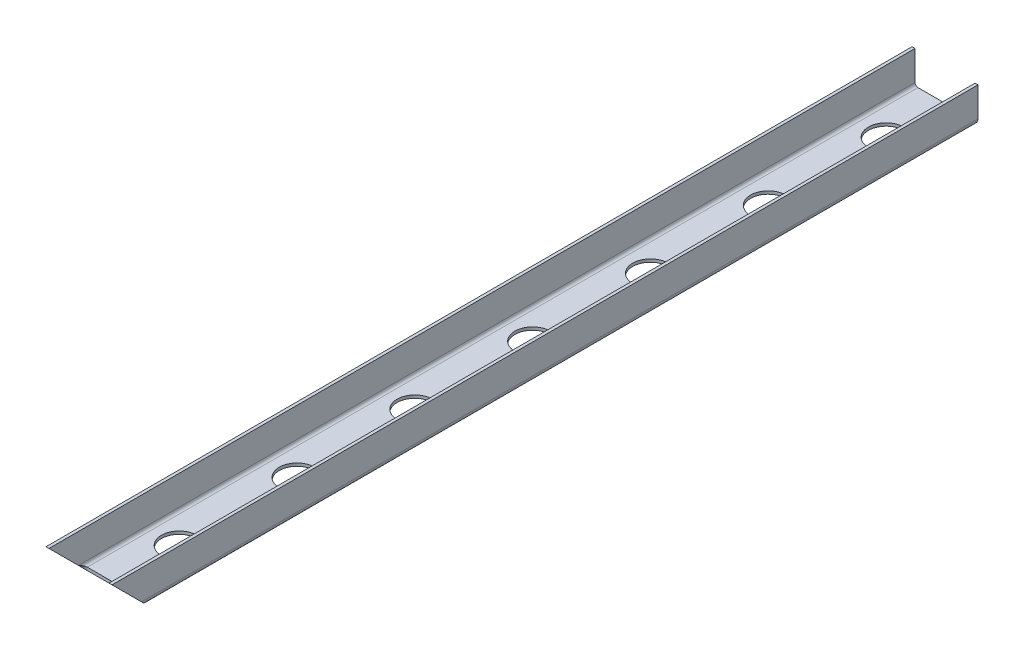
ISO-10303-21;
HEADER;
FILE_DESCRIPTION(('STEP AP214'),'2;1');
FILE_NAME('part.step','',(''),(''),'','','');
FILE_SCHEMA(('AUTOMOTIVE_DESIGN { 1 0 10303 214 1 1 1 1 }'));
ENDSEC;
DATA;
#1=APPLICATION_CONTEXT('core data for automotive mechanical design processes');
#2=APPLICATION_PROTOCOL_DEFINITION('international standard','automotive_design',2000,#1);
#3=PRODUCT_CONTEXT('',#1,'mechanical');
#4=PRODUCT('Part','Part','',(#3));
#5=PRODUCT_RELATED_PRODUCT_CATEGORY('part','',(#4));
#6=PRODUCT_DEFINITION_FORMATION('','',#4);
#7=PRODUCT_DEFINITION_CONTEXT('part definition',#1,'design');
#8=PRODUCT_DEFINITION('design','',#6,#7);
#9=PRODUCT_DEFINITION_SHAPE('','',#8);
#10=(LENGTH_UNIT() NAMED_UNIT(*) SI_UNIT(.MILLI.,.METRE.));
#11=(NAMED_UNIT(*) PLANE_ANGLE_UNIT() SI_UNIT($,.RADIAN.));
#12=(NAMED_UNIT(*) SI_UNIT($,.STERADIAN.) SOLID_ANGLE_UNIT());
#13=UNCERTAINTY_MEASURE_WITH_UNIT(LENGTH_MEASURE(1.E-05),#10,'distance_accuracy_value','');
#14=(GEOMETRIC_REPRESENTATION_CONTEXT(3) GLOBAL_UNCERTAINTY_ASSIGNED_CONTEXT((#13)) GLOBAL_UNIT_ASSIGNED_CONTEXT((#10,
#11,#12)) REPRESENTATION_CONTEXT('',''));
#15=CARTESIAN_POINT('',(0.,0.,0.));
#16=DIRECTION('',(0.,0.,1.));
#17=DIRECTION('',(1.,0.,0.));
#18=AXIS2_PLACEMENT_3D('',#15,#16,#17);
#19=CARTESIAN_POINT('',(28.,0.,367.5));
#20=DIRECTION('',(-1.,0.,0.));
#21=DIRECTION('',(0.,0.,1.));
#22=AXIS2_PLACEMENT_3D('',#19,#20,#21);
#23=PLANE('',#22);
#24=DIRECTION('',(0.,-0.707106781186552,-0.707106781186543));
#25=VECTOR('',#24,1.);
#26=CARTESIAN_POINT('',(28.,13.7499999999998,353.75));
#27=LINE('',#26,#25);
#28=CARTESIAN_POINT('',(28.,27.5,367.5));
#29=VERTEX_POINT('',#28);
#30=CARTESIAN_POINT('',(28.,2.50000000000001,342.5));
#31=VERTEX_POINT('',#30);
#32=EDGE_CURVE('E416',#29,#31,#27,.T.);
#33=ORIENTED_EDGE('',*,*,#32,.T.);
#34=DIRECTION('',(0.,0.,-1.));
#35=VECTOR('',#34,1.);
#36=CARTESIAN_POINT('',(28.,2.50000000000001,367.5));
#37=LINE('',#36,#35);
#38=CARTESIAN_POINT('',(28.,2.50000000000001,-367.5));
#39=VERTEX_POINT('',#38);
#40=EDGE_CURVE('E64',#31,#39,#37,.T.);
#41=ORIENTED_EDGE('',*,*,#40,.T.);
#42=DIRECTION('',(0.,1.,0.));
#43=VECTOR('',#42,1.);
#44=CARTESIAN_POINT('',(28.,0.,-367.5));
#45=LINE('',#44,#43);
#46=CARTESIAN_POINT('',(28.,27.5,-367.5));
#47=VERTEX_POINT('',#46);
#48=EDGE_CURVE('E411',#39,#47,#45,.T.);
#49=ORIENTED_EDGE('',*,*,#48,.T.);
#50=DIRECTION('',(0.,0.,-1.));
#51=VECTOR('',#50,1.);
#52=CARTESIAN_POINT('',(28.,27.5,367.5));
#53=LINE('',#52,#51);
#54=EDGE_CURVE('E207',#29,#47,#53,.T.);
#55=ORIENTED_EDGE('',*,*,#54,.F.);
#56=EDGE_LOOP('',(#33,#41,#49,#55));
#57=FACE_BOUND('',#56,.T.);
#58=ADVANCED_FACE('F40',(#57),#23,.F.);
#59=CARTESIAN_POINT('',(25.5,0.,367.5));
#60=DIRECTION('',(-1.,0.,0.));
#61=DIRECTION('',(0.,0.,1.));
#62=AXIS2_PLACEMENT_3D('',#59,#60,#61);
#63=PLANE('',#62);
#64=DIRECTION('',(0.,0.,-1.));
#65=VECTOR('',#64,1.);
#66=CARTESIAN_POINT('',(25.5,2.50000000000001,367.5));
#67=LINE('',#66,#65);
#68=CARTESIAN_POINT('',(25.5,2.50000000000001,342.5));
#69=VERTEX_POINT('',#68);
#70=CARTESIAN_POINT('',(25.5,2.50000000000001,-367.5));
#71=VERTEX_POINT('',#70);
#72=EDGE_CURVE('E201',#69,#71,#67,.T.);
#73=ORIENTED_EDGE('',*,*,#72,.F.);
#74=DIRECTION('',(0.,-0.707106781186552,-0.707106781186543));
#75=VECTOR('',#74,1.);
#76=CARTESIAN_POINT('',(25.5,13.7499999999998,353.75));
#77=LINE('',#76,#75);
#78=CARTESIAN_POINT('',(25.5,27.5,367.5));
#79=VERTEX_POINT('',#78);
#80=EDGE_CURVE('E419',#79,#69,#77,.T.);
#81=ORIENTED_EDGE('',*,*,#80,.F.);
#82=DIRECTION('',(0.,0.,-1.));
#83=VECTOR('',#82,1.);
#84=CARTESIAN_POINT('',(25.5,27.5,367.5));
#85=LINE('',#84,#83);
#86=CARTESIAN_POINT('',(25.5,27.5,-367.5));
#87=VERTEX_POINT('',#86);
#88=EDGE_CURVE('E204',#79,#87,#85,.T.);
#89=ORIENTED_EDGE('',*,*,#88,.T.);
#90=DIRECTION('',(0.,1.,0.));
#91=VECTOR('',#90,1.);
#92=CARTESIAN_POINT('',(25.5,0.,-367.5));
#93=LINE('',#92,#91);
#94=EDGE_CURVE('E403',#71,#87,#93,.T.);
#95=ORIENTED_EDGE('',*,*,#94,.F.);
#96=EDGE_LOOP('',(#73,#81,#89,#95));
#97=FACE_BOUND('',#96,.T.);
#98=ADVANCED_FACE('F275',(#97),#63,.T.);
#99=CARTESIAN_POINT('',(23.,2.50000000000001,367.5));
#100=DIRECTION('',(0.,0.,-1.));
#101=DIRECTION('',(-1.,0.,0.));
#102=AXIS2_PLACEMENT_3D('',#99,#100,#101);
#103=CYLINDRICAL_SURFACE('',#102,2.5);
#104=DIRECTION('',(0.,0.,-1.));
#105=VECTOR('',#104,1.);
#106=CARTESIAN_POINT('',(23.,0.,367.5));
#107=LINE('',#106,#105);
#108=CARTESIAN_POINT('',(23.,0.,337.5));
#109=VERTEX_POINT('',#108);
#110=CARTESIAN_POINT('',(23.,0.,-367.5));
#111=VERTEX_POINT('',#110);
#112=EDGE_CURVE('E198',#109,#111,#107,.T.);
#113=ORIENTED_EDGE('',*,*,#112,.F.);
#114=CARTESIAN_POINT('',(23.,2.50000000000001,342.5));
#115=DIRECTION('',(0.,0.894427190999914,-0.447213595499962));
#116=DIRECTION('',(0.,-0.447213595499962,-0.894427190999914));
#117=AXIS2_PLACEMENT_3D('',#114,#115,#116);
#118=ELLIPSE('',#117,5.59016994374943,2.5);
#119=EDGE_CURVE('E139',#69,#109,#118,.T.);
#120=ORIENTED_EDGE('',*,*,#119,.F.);
#121=ORIENTED_EDGE('',*,*,#72,.T.);
#122=CARTESIAN_POINT('',(23.,2.50000000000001,-367.5));
#123=DIRECTION('',(0.,0.,-1.));
#124=DIRECTION('',(-1.,0.,0.));
#125=AXIS2_PLACEMENT_3D('',#122,#123,#124);
#126=CIRCLE('',#125,2.5);
#127=EDGE_CURVE('E400',#111,#71,#126,.F.);
#128=ORIENTED_EDGE('',*,*,#127,.F.);
#129=EDGE_LOOP('',(#113,#120,#121,#128));
#130=FACE_BOUND('',#129,.T.);
#131=ADVANCED_FACE('F265',(#130),#103,.F.);
#132=CARTESIAN_POINT('',(-25.5,0.,367.5));
#133=DIRECTION('',(0.,1.,0.));
#134=DIRECTION('',(-1.,0.,0.));
#135=AXIS2_PLACEMENT_3D('',#132,#133,#134);
#136=PLANE('',#135);
#137=CARTESIAN_POINT('',(0.,0.,-217.5));
#138=DIRECTION('',(0.,1.,0.));
#139=DIRECTION('',(-1.,0.,0.));
#140=AXIS2_PLACEMENT_3D('',#137,#138,#139);
#141=CIRCLE('',#140,15.);
#142=CARTESIAN_POINT('',(-15.,0.,-217.5));
#143=VERTEX_POINT('',#142);
#144=EDGE_CURVE('E454',#143,#143,#141,.T.);
#145=ORIENTED_EDGE('',*,*,#144,.F.);
#146=EDGE_LOOP('',(#145));
#147=FACE_BOUND('',#146,.T.);
#148=CARTESIAN_POINT('',(0.,0.,-317.5));
#149=DIRECTION('',(0.,1.,0.));
#150=DIRECTION('',(-1.,0.,0.));
#151=AXIS2_PLACEMENT_3D('',#148,#149,#150);
#152=CIRCLE('',#151,15.);
#153=CARTESIAN_POINT('',(-15.,0.,-317.5));
#154=VERTEX_POINT('',#153);
#155=EDGE_CURVE('E446',#154,#154,#152,.T.);
#156=ORIENTED_EDGE('',*,*,#155,.F.);
#157=EDGE_LOOP('',(#156));
#158=FACE_BOUND('',#157,.T.);
#159=DIRECTION('',(0.,0.,-1.));
#160=VECTOR('',#159,1.);
#161=CARTESIAN_POINT('',(-23.,0.,367.5));
#162=LINE('',#161,#160);
#163=CARTESIAN_POINT('',(-23.,0.,337.5));
#164=VERTEX_POINT('',#163);
#165=CARTESIAN_POINT('',(-23.,0.,-367.5));
#166=VERTEX_POINT('',#165);
#167=EDGE_CURVE('E195',#164,#166,#162,.T.);
#168=ORIENTED_EDGE('',*,*,#167,.F.);
#169=DIRECTION('',(-1.,0.,0.));
#170=VECTOR('',#169,1.);
#171=CARTESIAN_POINT('',(-25.5,0.,337.5));
#172=LINE('',#171,#170);
#173=EDGE_CURVE('E144',#164,#109,#172,.F.);
#174=ORIENTED_EDGE('',*,*,#173,.T.);
#175=ORIENTED_EDGE('',*,*,#112,.T.);
#176=DIRECTION('',(1.,0.,0.));
#177=VECTOR('',#176,1.);
#178=CARTESIAN_POINT('',(-25.5,0.,-367.5));
#179=LINE('',#178,#177);
#180=EDGE_CURVE('E396',#166,#111,#179,.T.);
#181=ORIENTED_EDGE('',*,*,#180,.F.);
#182=EDGE_LOOP('',(#168,#174,#175,#181));
#183=FACE_BOUND('',#182,.T.);
#184=CARTESIAN_POINT('',(0.,0.,-117.5));
#185=DIRECTION('',(0.,1.,0.));
#186=DIRECTION('',(-1.,0.,0.));
#187=AXIS2_PLACEMENT_3D('',#184,#185,#186);
#188=CIRCLE('',#187,15.);
#189=CARTESIAN_POINT('',(-15.,0.,-117.5));
#190=VERTEX_POINT('',#189);
#191=EDGE_CURVE('E225',#190,#190,#188,.T.);
#192=ORIENTED_EDGE('',*,*,#191,.F.);
#193=EDGE_LOOP('',(#192));
#194=FACE_BOUND('',#193,.T.);
#195=CARTESIAN_POINT('',(0.,0.,-17.5));
#196=DIRECTION('',(0.,1.,0.));
#197=DIRECTION('',(-1.,0.,0.));
#198=AXIS2_PLACEMENT_3D('',#195,#196,#197);
#199=CIRCLE('',#198,15.);
#200=CARTESIAN_POINT('',(-15.,0.,-17.5));
#201=VERTEX_POINT('',#200);
#202=EDGE_CURVE('E233',#201,#201,#199,.T.);
#203=ORIENTED_EDGE('',*,*,#202,.F.);
#204=EDGE_LOOP('',(#203));
#205=FACE_BOUND('',#204,.T.);
#206=CARTESIAN_POINT('',(0.,0.,82.5));
#207=DIRECTION('',(0.,1.,0.));
#208=DIRECTION('',(-1.,0.,0.));
#209=AXIS2_PLACEMENT_3D('',#206,#207,#208);
#210=CIRCLE('',#209,15.);
#211=CARTESIAN_POINT('',(-15.,0.,82.5));
#212=VERTEX_POINT('',#211);
#213=EDGE_CURVE('E241',#212,#212,#210,.T.);
#214=ORIENTED_EDGE('',*,*,#213,.F.);
#215=EDGE_LOOP('',(#214));
#216=FACE_BOUND('',#215,.T.);
#217=CARTESIAN_POINT('',(0.,0.,182.5));
#218=DIRECTION('',(0.,1.,0.));
#219=DIRECTION('',(-1.,0.,0.));
#220=AXIS2_PLACEMENT_3D('',#217,#218,#219);
#221=CIRCLE('',#220,15.);
#222=CARTESIAN_POINT('',(-15.,0.,182.5));
#223=VERTEX_POINT('',#222);
#224=EDGE_CURVE('E249',#223,#223,#221,.T.);
#225=ORIENTED_EDGE('',*,*,#224,.F.);
#226=EDGE_LOOP('',(#225));
#227=FACE_BOUND('',#226,.T.);
#228=CARTESIAN_POINT('',(0.,0.,282.5));
#229=DIRECTION('',(0.,1.,0.));
#230=DIRECTION('',(-1.,0.,0.));
#231=AXIS2_PLACEMENT_3D('',#228,#229,#230);
#232=CIRCLE('',#231,15.);
#233=CARTESIAN_POINT('',(-15.,0.,282.5));
#234=VERTEX_POINT('',#233);
#235=EDGE_CURVE('E49',#234,#234,#232,.T.);
#236=ORIENTED_EDGE('',*,*,#235,.F.);
#237=EDGE_LOOP('',(#236));
#238=FACE_BOUND('',#237,.T.);
#239=ADVANCED_FACE('F262',(#147,#158,#183,#194,#205,#216,#227,#238),#136,.T.);
#240=CARTESIAN_POINT('',(-23.,2.5,367.5));
#241=DIRECTION('',(0.,0.,-1.));
#242=DIRECTION('',(-1.,0.,0.));
#243=AXIS2_PLACEMENT_3D('',#240,#241,#242);
#244=CYLINDRICAL_SURFACE('',#243,2.5);
#245=DIRECTION('',(0.,0.,-1.));
#246=VECTOR('',#245,1.);
#247=CARTESIAN_POINT('',(-25.5,2.5,367.5));
#248=LINE('',#247,#246);
#249=CARTESIAN_POINT('',(-25.5,2.5,342.5));
#250=VERTEX_POINT('',#249);
#251=CARTESIAN_POINT('',(-25.5,2.5,-367.5));
#252=VERTEX_POINT('',#251);
#253=EDGE_CURVE('E192',#250,#252,#248,.T.);
#254=ORIENTED_EDGE('',*,*,#253,.F.);
#255=CARTESIAN_POINT('',(-23.,2.5,342.5));
#256=DIRECTION('',(0.,0.894427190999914,-0.447213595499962));
#257=DIRECTION('',(0.,-0.447213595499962,-0.894427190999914));
#258=AXIS2_PLACEMENT_3D('',#255,#256,#257);
#259=ELLIPSE('',#258,5.59016994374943,2.5);
#260=EDGE_CURVE('E434',#164,#250,#259,.T.);
#261=ORIENTED_EDGE('',*,*,#260,.F.);
#262=ORIENTED_EDGE('',*,*,#167,.T.);
#263=CARTESIAN_POINT('',(-23.,2.5,-367.5));
#264=DIRECTION('',(0.,0.,-1.));
#265=DIRECTION('',(-1.,0.,0.));
#266=AXIS2_PLACEMENT_3D('',#263,#264,#265);
#267=CIRCLE('',#266,2.5);
#268=EDGE_CURVE('E392',#252,#166,#267,.F.);
#269=ORIENTED_EDGE('',*,*,#268,.F.);
#270=EDGE_LOOP('',(#254,#261,#262,#269));
#271=FACE_BOUND('',#270,.T.);
#272=ADVANCED_FACE('F264',(#271),#244,.F.);
#273=CARTESIAN_POINT('',(-25.5,27.5,367.5));
#274=DIRECTION('',(1.,0.,0.));
#275=DIRECTION('',(0.,1.,0.));
#276=AXIS2_PLACEMENT_3D('',#273,#274,#275);
#277=PLANE('',#276);
#278=DIRECTION('',(0.,0.,-1.));
#279=VECTOR('',#278,1.);
#280=CARTESIAN_POINT('',(-25.5,27.5,367.5));
#281=LINE('',#280,#279);
#282=CARTESIAN_POINT('',(-25.5,27.5,367.5));
#283=VERTEX_POINT('',#282);
#284=CARTESIAN_POINT('',(-25.5,27.5,-367.5));
#285=VERTEX_POINT('',#284);
#286=EDGE_CURVE('E189',#283,#285,#281,.T.);
#287=ORIENTED_EDGE('',*,*,#286,.F.);
#288=DIRECTION('',(0.,0.707106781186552,0.707106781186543));
#289=VECTOR('',#288,1.);
#290=CARTESIAN_POINT('',(-25.5,-2.5,337.5));
#291=LINE('',#290,#289);
#292=EDGE_CURVE('E56',#250,#283,#291,.T.);
#293=ORIENTED_EDGE('',*,*,#292,.F.);
#294=ORIENTED_EDGE('',*,*,#253,.T.);
#295=DIRECTION('',(0.,-1.,0.));
#296=VECTOR('',#295,1.);
#297=CARTESIAN_POINT('',(-25.5,27.5,-367.5));
#298=LINE('',#297,#296);
#299=EDGE_CURVE('E362',#285,#252,#298,.T.);
#300=ORIENTED_EDGE('',*,*,#299,.F.);
#301=EDGE_LOOP('',(#287,#293,#294,#300));
#302=FACE_BOUND('',#301,.T.);
#303=ADVANCED_FACE('F272',(#302),#277,.T.);
#304=CARTESIAN_POINT('',(-28.,27.5,367.5));
#305=DIRECTION('',(1.,0.,0.));
#306=DIRECTION('',(0.,1.,0.));
#307=AXIS2_PLACEMENT_3D('',#304,#305,#306);
#308=PLANE('',#307);
#309=DIRECTION('',(0.,0.707106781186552,0.707106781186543));
#310=VECTOR('',#309,1.);
#311=CARTESIAN_POINT('',(-28.,-2.5,337.5));
#312=LINE('',#311,#310);
#313=CARTESIAN_POINT('',(-28.,2.5,342.5));
#314=VERTEX_POINT('',#313);
#315=CARTESIAN_POINT('',(-28.,27.5,367.5));
#316=VERTEX_POINT('',#315);
#317=EDGE_CURVE('E431',#314,#316,#312,.T.);
#318=ORIENTED_EDGE('',*,*,#317,.T.);
#319=DIRECTION('',(0.,0.,-1.));
#320=VECTOR('',#319,1.);
#321=CARTESIAN_POINT('',(-28.,27.5,367.5));
#322=LINE('',#321,#320);
#323=CARTESIAN_POINT('',(-28.,27.5,-367.5));
#324=VERTEX_POINT('',#323);
#325=EDGE_CURVE('E186',#316,#324,#322,.T.);
#326=ORIENTED_EDGE('',*,*,#325,.T.);
#327=DIRECTION('',(0.,-1.,0.));
#328=VECTOR('',#327,1.);
#329=CARTESIAN_POINT('',(-28.,27.5,-367.5));
#330=LINE('',#329,#328);
#331=CARTESIAN_POINT('',(-28.,2.5,-367.5));
#332=VERTEX_POINT('',#331);
#333=EDGE_CURVE('E383',#324,#332,#330,.T.);
#334=ORIENTED_EDGE('',*,*,#333,.T.);
#335=DIRECTION('',(0.,0.,-1.));
#336=VECTOR('',#335,1.);
#337=CARTESIAN_POINT('',(-28.,2.5,367.5));
#338=LINE('',#337,#336);
#339=EDGE_CURVE('E177',#314,#332,#338,.T.);
#340=ORIENTED_EDGE('',*,*,#339,.F.);
#341=EDGE_LOOP('',(#318,#326,#334,#340));
#342=FACE_BOUND('',#341,.T.);
#343=ADVANCED_FACE('F339',(#342),#308,.F.);
#344=CARTESIAN_POINT('',(-23.,2.5,367.5));
#345=DIRECTION('',(0.,0.,-1.));
#346=DIRECTION('',(-1.,0.,0.));
#347=AXIS2_PLACEMENT_3D('',#344,#345,#346);
#348=CYLINDRICAL_SURFACE('',#347,5.);
#349=CARTESIAN_POINT('',(-23.,2.5,342.5));
#350=DIRECTION('',(0.,0.707106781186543,-0.707106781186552));
#351=DIRECTION('',(0.,-0.707106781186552,-0.707106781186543));
#352=AXIS2_PLACEMENT_3D('',#349,#350,#351);
#353=ELLIPSE('',#352,7.07106781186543,5.);
#354=CARTESIAN_POINT('',(-23.,-2.5,337.5));
#355=VERTEX_POINT('',#354);
#356=EDGE_CURVE('E437',#355,#314,#353,.T.);
#357=ORIENTED_EDGE('',*,*,#356,.T.);
#358=ORIENTED_EDGE('',*,*,#339,.T.);
#359=CARTESIAN_POINT('',(-23.,2.5,-367.5));
#360=DIRECTION('',(0.,0.,1.));
#361=DIRECTION('',(1.,0.,0.));
#362=AXIS2_PLACEMENT_3D('',#359,#360,#361);
#363=CIRCLE('',#362,5.);
#364=CARTESIAN_POINT('',(-23.,-2.5,-367.5));
#365=VERTEX_POINT('',#364);
#366=EDGE_CURVE('E379',#332,#365,#363,.T.);
#367=ORIENTED_EDGE('',*,*,#366,.T.);
#368=DIRECTION('',(0.,0.,-1.));
#369=VECTOR('',#368,1.);
#370=CARTESIAN_POINT('',(-23.,-2.5,367.5));
#371=LINE('',#370,#369);
#372=EDGE_CURVE('E172',#355,#365,#371,.T.);
#373=ORIENTED_EDGE('',*,*,#372,.F.);
#374=EDGE_LOOP('',(#357,#358,#367,#373));
#375=FACE_BOUND('',#374,.T.);
#376=ADVANCED_FACE('F330',(#375),#348,.T.);
#377=CARTESIAN_POINT('',(-25.5,-2.5,367.5));
#378=DIRECTION('',(0.,1.,0.));
#379=DIRECTION('',(-1.,0.,0.));
#380=AXIS2_PLACEMENT_3D('',#377,#378,#379);
#381=PLANE('',#380);
#382=CARTESIAN_POINT('',(0.,-2.5,-217.5));
#383=DIRECTION('',(0.,1.,0.));
#384=DIRECTION('',(-1.,0.,0.));
#385=AXIS2_PLACEMENT_3D('',#382,#383,#384);
#386=CIRCLE('',#385,15.);
#387=CARTESIAN_POINT('',(-15.,-2.5,-217.5));
#388=VERTEX_POINT('',#387);
#389=EDGE_CURVE('E450',#388,#388,#386,.F.);
#390=ORIENTED_EDGE('',*,*,#389,.F.);
#391=EDGE_LOOP('',(#390));
#392=FACE_BOUND('',#391,.T.);
#393=CARTESIAN_POINT('',(0.,-2.5,-317.5));
#394=DIRECTION('',(0.,1.,0.));
#395=DIRECTION('',(-1.,0.,0.));
#396=AXIS2_PLACEMENT_3D('',#393,#394,#395);
#397=CIRCLE('',#396,15.);
#398=CARTESIAN_POINT('',(-15.,-2.5,-317.5));
#399=VERTEX_POINT('',#398);
#400=EDGE_CURVE('E163',#399,#399,#397,.F.);
#401=ORIENTED_EDGE('',*,*,#400,.F.);
#402=EDGE_LOOP('',(#401));
#403=FACE_BOUND('',#402,.T.);
#404=DIRECTION('',(1.,0.,0.));
#405=VECTOR('',#404,1.);
#406=CARTESIAN_POINT('',(-28.,-2.5,337.5));
#407=LINE('',#406,#405);
#408=CARTESIAN_POINT('',(23.,-2.49999999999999,337.5));
#409=VERTEX_POINT('',#408);
#410=EDGE_CURVE('E147',#355,#409,#407,.T.);
#411=ORIENTED_EDGE('',*,*,#410,.F.);
#412=ORIENTED_EDGE('',*,*,#372,.T.);
#413=DIRECTION('',(1.,0.,0.));
#414=VECTOR('',#413,1.);
#415=CARTESIAN_POINT('',(-25.5,-2.5,-367.5));
#416=LINE('',#415,#414);
#417=CARTESIAN_POINT('',(23.,-2.49999999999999,-367.5));
#418=VERTEX_POINT('',#417);
#419=EDGE_CURVE('E169',#365,#418,#416,.T.);
#420=ORIENTED_EDGE('',*,*,#419,.T.);
#421=DIRECTION('',(0.,0.,-1.));
#422=VECTOR('',#421,1.);
#423=CARTESIAN_POINT('',(23.,-2.49999999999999,367.5));
#424=LINE('',#423,#422);
#425=EDGE_CURVE('E160',#409,#418,#424,.T.);
#426=ORIENTED_EDGE('',*,*,#425,.F.);
#427=EDGE_LOOP('',(#411,#412,#420,#426));
#428=FACE_BOUND('',#427,.T.);
#429=CARTESIAN_POINT('',(0.,-2.5,-117.5));
#430=DIRECTION('',(0.,1.,0.));
#431=DIRECTION('',(-1.,0.,0.));
#432=AXIS2_PLACEMENT_3D('',#429,#430,#431);
#433=CIRCLE('',#432,15.);
#434=CARTESIAN_POINT('',(-15.,-2.5,-117.5));
#435=VERTEX_POINT('',#434);
#436=EDGE_CURVE('E229',#435,#435,#433,.F.);
#437=ORIENTED_EDGE('',*,*,#436,.F.);
#438=EDGE_LOOP('',(#437));
#439=FACE_BOUND('',#438,.T.);
#440=CARTESIAN_POINT('',(0.,-2.5,-17.5));
#441=DIRECTION('',(0.,1.,0.));
#442=DIRECTION('',(-1.,0.,0.));
#443=AXIS2_PLACEMENT_3D('',#440,#441,#442);
#444=CIRCLE('',#443,15.);
#445=CARTESIAN_POINT('',(-15.,-2.5,-17.5));
#446=VERTEX_POINT('',#445);
#447=EDGE_CURVE('E237',#446,#446,#444,.F.);
#448=ORIENTED_EDGE('',*,*,#447,.F.);
#449=EDGE_LOOP('',(#448));
#450=FACE_BOUND('',#449,.T.);
#451=CARTESIAN_POINT('',(0.,-2.5,82.5));
#452=DIRECTION('',(0.,1.,0.));
#453=DIRECTION('',(-1.,0.,0.));
#454=AXIS2_PLACEMENT_3D('',#451,#452,#453);
#455=CIRCLE('',#454,15.);
#456=CARTESIAN_POINT('',(-15.,-2.5,82.5));
#457=VERTEX_POINT('',#456);
#458=EDGE_CURVE('E245',#457,#457,#455,.F.);
#459=ORIENTED_EDGE('',*,*,#458,.F.);
#460=EDGE_LOOP('',(#459));
#461=FACE_BOUND('',#460,.T.);
#462=CARTESIAN_POINT('',(0.,-2.5,182.5));
#463=DIRECTION('',(0.,1.,0.));
#464=DIRECTION('',(-1.,0.,0.));
#465=AXIS2_PLACEMENT_3D('',#462,#463,#464);
#466=CIRCLE('',#465,15.);
#467=CARTESIAN_POINT('',(-15.,-2.5,182.5));
#468=VERTEX_POINT('',#467);
#469=EDGE_CURVE('E253',#468,#468,#466,.F.);
#470=ORIENTED_EDGE('',*,*,#469,.F.);
#471=EDGE_LOOP('',(#470));
#472=FACE_BOUND('',#471,.T.);
#473=CARTESIAN_POINT('',(0.,-2.5,282.5));
#474=DIRECTION('',(0.,1.,0.));
#475=DIRECTION('',(-1.,0.,0.));
#476=AXIS2_PLACEMENT_3D('',#473,#474,#475);
#477=CIRCLE('',#476,15.);
#478=CARTESIAN_POINT('',(-15.,-2.5,282.5));
#479=VERTEX_POINT('',#478);
#480=EDGE_CURVE('E11',#479,#479,#477,.F.);
#481=ORIENTED_EDGE('',*,*,#480,.F.);
#482=EDGE_LOOP('',(#481));
#483=FACE_BOUND('',#482,.T.);
#484=ADVANCED_FACE('F166',(#392,#403,#428,#439,#450,#461,#472,#483),#381,.F.);
#485=CARTESIAN_POINT('',(23.,2.50000000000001,367.5));
#486=DIRECTION('',(0.,0.,-1.));
#487=DIRECTION('',(-1.,0.,0.));
#488=AXIS2_PLACEMENT_3D('',#485,#486,#487);
#489=CYLINDRICAL_SURFACE('',#488,5.);
#490=CARTESIAN_POINT('',(23.,2.50000000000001,342.5));
#491=DIRECTION('',(0.,0.707106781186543,-0.707106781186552));
#492=DIRECTION('',(0.,-0.707106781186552,-0.707106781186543));
#493=AXIS2_PLACEMENT_3D('',#490,#491,#492);
#494=ELLIPSE('',#493,7.07106781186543,5.);
#495=EDGE_CURVE('E136',#31,#409,#494,.T.);
#496=ORIENTED_EDGE('',*,*,#495,.T.);
#497=ORIENTED_EDGE('',*,*,#425,.T.);
#498=CARTESIAN_POINT('',(23.,2.50000000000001,-367.5));
#499=DIRECTION('',(0.,0.,1.));
#500=DIRECTION('',(1.,0.,0.));
#501=AXIS2_PLACEMENT_3D('',#498,#499,#500);
#502=CIRCLE('',#501,5.);
#503=EDGE_CURVE('E372',#418,#39,#502,.T.);
#504=ORIENTED_EDGE('',*,*,#503,.T.);
#505=ORIENTED_EDGE('',*,*,#40,.F.);
#506=EDGE_LOOP('',(#496,#497,#504,#505));
#507=FACE_BOUND('',#506,.T.);
#508=ADVANCED_FACE('F158',(#507),#489,.T.);
#509=CARTESIAN_POINT('',(-25.5,2.5,-367.5));
#510=DIRECTION('',(0.,0.,-1.));
#511=DIRECTION('',(-1.,0.,0.));
#512=AXIS2_PLACEMENT_3D('',#509,#510,#511);
#513=PLANE('',#512);
#514=DIRECTION('',(-1.,0.,0.));
#515=VECTOR('',#514,1.);
#516=CARTESIAN_POINT('',(-25.5,2.5,-367.5));
#517=LINE('',#516,#515);
#518=EDGE_CURVE('E221',#252,#332,#517,.T.);
#519=ORIENTED_EDGE('',*,*,#518,.F.);
#520=ORIENTED_EDGE('',*,*,#268,.T.);
#521=DIRECTION('',(0.,1.,0.));
#522=VECTOR('',#521,1.);
#523=CARTESIAN_POINT('',(-23.,-2.5,-367.5));
#524=LINE('',#523,#522);
#525=EDGE_CURVE('E217',#365,#166,#524,.T.);
#526=ORIENTED_EDGE('',*,*,#525,.F.);
#527=ORIENTED_EDGE('',*,*,#366,.F.);
#528=EDGE_LOOP('',(#519,#520,#526,#527));
#529=FACE_BOUND('',#528,.T.);
#530=ADVANCED_FACE('F301',(#529),#513,.T.);
#531=CARTESIAN_POINT('',(-23.,-2.5,-367.5));
#532=DIRECTION('',(0.,0.,-1.));
#533=DIRECTION('',(-1.,0.,0.));
#534=AXIS2_PLACEMENT_3D('',#531,#532,#533);
#535=PLANE('',#534);
#536=ORIENTED_EDGE('',*,*,#299,.T.);
#537=ORIENTED_EDGE('',*,*,#518,.T.);
#538=ORIENTED_EDGE('',*,*,#333,.F.);
#539=DIRECTION('',(1.,0.,0.));
#540=VECTOR('',#539,1.);
#541=CARTESIAN_POINT('',(-28.,27.5,-367.5));
#542=LINE('',#541,#540);
#543=EDGE_CURVE('E387',#324,#285,#542,.T.);
#544=ORIENTED_EDGE('',*,*,#543,.T.);
#545=EDGE_LOOP('',(#536,#537,#538,#544));
#546=FACE_BOUND('',#545,.T.);
#547=ADVANCED_FACE('F297',(#546),#535,.T.);
#548=CARTESIAN_POINT('',(23.,0.,-367.5));
#549=DIRECTION('',(0.,0.,-1.));
#550=DIRECTION('',(-1.,0.,0.));
#551=AXIS2_PLACEMENT_3D('',#548,#549,#550);
#552=PLANE('',#551);
#553=DIRECTION('',(0.,-1.,0.));
#554=VECTOR('',#553,1.);
#555=CARTESIAN_POINT('',(23.,0.,-367.5));
#556=LINE('',#555,#554);
#557=EDGE_CURVE('E214',#111,#418,#556,.T.);
#558=ORIENTED_EDGE('',*,*,#557,.F.);
#559=ORIENTED_EDGE('',*,*,#127,.T.);
#560=DIRECTION('',(-1.,0.,0.));
#561=VECTOR('',#560,1.);
#562=CARTESIAN_POINT('',(28.,2.50000000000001,-367.5));
#563=LINE('',#562,#561);
#564=EDGE_CURVE('E210',#39,#71,#563,.T.);
#565=ORIENTED_EDGE('',*,*,#564,.F.);
#566=ORIENTED_EDGE('',*,*,#503,.F.);
#567=EDGE_LOOP('',(#558,#559,#565,#566));
#568=FACE_BOUND('',#567,.T.);
#569=ADVANCED_FACE('F293',(#568),#552,.T.);
#570=CARTESIAN_POINT('',(28.,2.50000000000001,-367.5));
#571=DIRECTION('',(0.,0.,-1.));
#572=DIRECTION('',(-1.,0.,0.));
#573=AXIS2_PLACEMENT_3D('',#570,#571,#572);
#574=PLANE('',#573);
#575=ORIENTED_EDGE('',*,*,#180,.T.);
#576=ORIENTED_EDGE('',*,*,#557,.T.);
#577=ORIENTED_EDGE('',*,*,#419,.F.);
#578=ORIENTED_EDGE('',*,*,#525,.T.);
#579=EDGE_LOOP('',(#575,#576,#577,#578));
#580=FACE_BOUND('',#579,.T.);
#581=ADVANCED_FACE('F290',(#580),#574,.T.);
#582=CARTESIAN_POINT('',(25.5,27.5,367.5));
#583=DIRECTION('',(0.,1.,0.));
#584=DIRECTION('',(0.,0.,1.));
#585=AXIS2_PLACEMENT_3D('',#582,#583,#584);
#586=PLANE('',#585);
#587=DIRECTION('',(1.,0.,0.));
#588=VECTOR('',#587,1.);
#589=CARTESIAN_POINT('',(25.5,27.5,-367.5));
#590=LINE('',#589,#588);
#591=EDGE_CURVE('E407',#87,#47,#590,.T.);
#592=ORIENTED_EDGE('',*,*,#591,.F.);
#593=ORIENTED_EDGE('',*,*,#88,.F.);
#594=DIRECTION('',(1.,0.,0.));
#595=VECTOR('',#594,1.);
#596=CARTESIAN_POINT('',(25.5,27.5,367.5));
#597=LINE('',#596,#595);
#598=EDGE_CURVE('E369',#79,#29,#597,.T.);
#599=ORIENTED_EDGE('',*,*,#598,.T.);
#600=ORIENTED_EDGE('',*,*,#54,.T.);
#601=EDGE_LOOP('',(#592,#593,#599,#600));
#602=FACE_BOUND('',#601,.T.);
#603=ADVANCED_FACE('F289',(#602),#586,.T.);
#604=CARTESIAN_POINT('',(-28.,27.5,367.5));
#605=DIRECTION('',(0.,1.,0.));
#606=DIRECTION('',(0.,0.,1.));
#607=AXIS2_PLACEMENT_3D('',#604,#605,#606);
#608=PLANE('',#607);
#609=ORIENTED_EDGE('',*,*,#543,.F.);
#610=ORIENTED_EDGE('',*,*,#325,.F.);
#611=DIRECTION('',(1.,0.,0.));
#612=VECTOR('',#611,1.);
#613=CARTESIAN_POINT('',(-28.,27.5,367.5));
#614=LINE('',#613,#612);
#615=EDGE_CURVE('E180',#316,#283,#614,.T.);
#616=ORIENTED_EDGE('',*,*,#615,.T.);
#617=ORIENTED_EDGE('',*,*,#286,.T.);
#618=EDGE_LOOP('',(#609,#610,#616,#617));
#619=FACE_BOUND('',#618,.T.);
#620=ADVANCED_FACE('F349',(#619),#608,.T.);
#621=CARTESIAN_POINT('',(23.,2.50000000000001,-367.5));
#622=DIRECTION('',(0.,0.,-1.));
#623=DIRECTION('',(-1.,0.,0.));
#624=AXIS2_PLACEMENT_3D('',#621,#622,#623);
#625=PLANE('',#624);
#626=ORIENTED_EDGE('',*,*,#48,.F.);
#627=ORIENTED_EDGE('',*,*,#564,.T.);
#628=ORIENTED_EDGE('',*,*,#94,.T.);
#629=ORIENTED_EDGE('',*,*,#591,.T.);
#630=EDGE_LOOP('',(#626,#627,#628,#629));
#631=FACE_BOUND('',#630,.T.);
#632=ADVANCED_FACE('F352',(#631),#625,.T.);
#633=CARTESIAN_POINT('',(25.5,13.7499999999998,353.75));
#634=DIRECTION('',(0.,0.707106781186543,-0.707106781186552));
#635=DIRECTION('',(0.,-0.707106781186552,-0.707106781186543));
#636=AXIS2_PLACEMENT_3D('',#633,#634,#635);
#637=PLANE('',#636);
#638=ORIENTED_EDGE('',*,*,#80,.T.);
#639=DIRECTION('',(-1.,0.,0.));
#640=VECTOR('',#639,1.);
#641=CARTESIAN_POINT('',(25.5,2.50000000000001,342.5));
#642=LINE('',#641,#640);
#643=EDGE_CURVE('E413',#69,#31,#642,.F.);
#644=ORIENTED_EDGE('',*,*,#643,.T.);
#645=ORIENTED_EDGE('',*,*,#32,.F.);
#646=ORIENTED_EDGE('',*,*,#598,.F.);
#647=EDGE_LOOP('',(#638,#644,#645,#646));
#648=FACE_BOUND('',#647,.T.);
#649=ADVANCED_FACE('F493',(#648),#637,.F.);
#650=CARTESIAN_POINT('',(-28.,-2.5,337.5));
#651=DIRECTION('',(0.,0.,1.));
#652=DIRECTION('',(1.,0.,0.));
#653=AXIS2_PLACEMENT_3D('',#650,#651,#652);
#654=PLANE('',#653);
#655=DIRECTION('',(0.,-1.,0.));
#656=VECTOR('',#655,1.);
#657=CARTESIAN_POINT('',(-23.,-2.5,337.5));
#658=LINE('',#657,#656);
#659=EDGE_CURVE('E143',#355,#164,#658,.F.);
#660=ORIENTED_EDGE('',*,*,#659,.F.);
#661=ORIENTED_EDGE('',*,*,#410,.T.);
#662=DIRECTION('',(0.,-1.,0.));
#663=VECTOR('',#662,1.);
#664=CARTESIAN_POINT('',(23.,-2.49999999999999,337.5));
#665=LINE('',#664,#663);
#666=EDGE_CURVE('E132',#409,#109,#665,.F.);
#667=ORIENTED_EDGE('',*,*,#666,.T.);
#668=ORIENTED_EDGE('',*,*,#173,.F.);
#669=EDGE_LOOP('',(#660,#661,#667,#668));
#670=FACE_BOUND('',#669,.T.);
#671=ADVANCED_FACE('F148',(#670),#654,.T.);
#672=CARTESIAN_POINT('',(-28.,-2.5,337.5));
#673=DIRECTION('',(0.,0.707106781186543,-0.707106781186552));
#674=DIRECTION('',(0.,0.707106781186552,0.707106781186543));
#675=AXIS2_PLACEMENT_3D('',#672,#673,#674);
#676=PLANE('',#675);
#677=ORIENTED_EDGE('',*,*,#615,.F.);
#678=ORIENTED_EDGE('',*,*,#317,.F.);
#679=DIRECTION('',(-1.,0.,0.));
#680=VECTOR('',#679,1.);
#681=CARTESIAN_POINT('',(-28.,2.5,342.5));
#682=LINE('',#681,#680);
#683=EDGE_CURVE('E155',#314,#250,#682,.F.);
#684=ORIENTED_EDGE('',*,*,#683,.T.);
#685=ORIENTED_EDGE('',*,*,#292,.T.);
#686=EDGE_LOOP('',(#677,#678,#684,#685));
#687=FACE_BOUND('',#686,.T.);
#688=ADVANCED_FACE('F482',(#687),#676,.F.);
#689=CARTESIAN_POINT('',(-23.,0.,337.5));
#690=CARTESIAN_POINT('',(-23.,-0.833333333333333,337.5));
#691=CARTESIAN_POINT('',(-23.,-1.66666666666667,337.5));
#692=CARTESIAN_POINT('',(-23.,-2.5,337.5));
#693=CARTESIAN_POINT('',(-28.,0.,337.5));
#694=CARTESIAN_POINT('',(-29.6666666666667,-0.833333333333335,337.5));
#695=CARTESIAN_POINT('',(-31.3333333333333,-1.66666666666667,337.5));
#696=CARTESIAN_POINT('',(-33.,-2.5,337.5));
#697=CARTESIAN_POINT('',(-28.,5.,347.5));
#698=CARTESIAN_POINT('',(-29.6666666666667,5.83333333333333,347.5));
#699=CARTESIAN_POINT('',(-31.3333333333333,6.66666666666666,347.5));
#700=CARTESIAN_POINT('',(-33.,7.5,347.5));
#701=CARTESIAN_POINT('',(-23.,5.,347.5));
#702=CARTESIAN_POINT('',(-23.,5.83333333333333,347.5));
#703=CARTESIAN_POINT('',(-23.,6.66666666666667,347.5));
#704=CARTESIAN_POINT('',(-23.,7.5,347.5));
#705=CARTESIAN_POINT('',(-18.,5.,347.5));
#706=CARTESIAN_POINT('',(-16.3333333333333,5.83333333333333,347.5));
#707=CARTESIAN_POINT('',(-14.6666666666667,6.66666666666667,347.5));
#708=CARTESIAN_POINT('',(-13.,7.5,347.5));
#709=CARTESIAN_POINT('',(-18.,0.,337.5));
#710=CARTESIAN_POINT('',(-16.3333333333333,-0.833333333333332,337.5));
#711=CARTESIAN_POINT('',(-14.6666666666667,-1.66666666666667,337.5));
#712=CARTESIAN_POINT('',(-13.,-2.5,337.5));
#713=CARTESIAN_POINT('',(-23.,0.,337.5));
#714=CARTESIAN_POINT('',(-23.,-0.833333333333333,337.5));
#715=CARTESIAN_POINT('',(-23.,-1.66666666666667,337.5));
#716=CARTESIAN_POINT('',(-23.,-2.5,337.5));
#717=(BOUNDED_SURFACE() B_SPLINE_SURFACE(3,3,((#689,#690,#691,#692),(#693,#694,#695,#696),(#697,
#698,#699,#700),(#701,#702,#703,#704),(#705,#706,#707,#708),(#709,#710,#711,#712),(#713,#714,
#715,#716)),.UNSPECIFIED.,.T.,.F.,.F.) B_SPLINE_SURFACE_WITH_KNOTS((4,3,4),(4,4),(0.,0.5,1.),
(0.,1.),.UNSPECIFIED.) GEOMETRIC_REPRESENTATION_ITEM() RATIONAL_B_SPLINE_SURFACE(((1.,1.,1.,1.),
(0.333333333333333,0.333333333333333,0.333333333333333,0.333333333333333),(0.333333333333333,
0.333333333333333,0.333333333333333,0.333333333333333),(1.,1.,1.,1.),(0.333333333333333,
0.333333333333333,0.333333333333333,0.333333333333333),(0.333333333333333,0.333333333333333,
0.333333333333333,0.333333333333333),(1.,1.,1.,1.))) REPRESENTATION_ITEM('') SURFACE());
#718=ORIENTED_EDGE('',*,*,#683,.F.);
#719=ORIENTED_EDGE('',*,*,#356,.F.);
#720=ORIENTED_EDGE('',*,*,#659,.T.);
#721=ORIENTED_EDGE('',*,*,#260,.T.);
#722=EDGE_LOOP('',(#718,#719,#720,#721));
#723=FACE_BOUND('',#722,.T.);
#724=ADVANCED_FACE('F472',(#723),#717,.T.);
#725=CARTESIAN_POINT('',(23.,0.,337.5));
#726=CARTESIAN_POINT('',(23.,-0.833333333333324,337.5));
#727=CARTESIAN_POINT('',(23.,-1.66666666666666,337.5));
#728=CARTESIAN_POINT('',(23.,-2.49999999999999,337.5));
#729=CARTESIAN_POINT('',(18.,0.,337.5));
#730=CARTESIAN_POINT('',(16.3333333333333,-0.833333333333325,337.5));
#731=CARTESIAN_POINT('',(14.6666666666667,-1.66666666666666,337.5));
#732=CARTESIAN_POINT('',(13.,-2.49999999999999,337.5));
#733=CARTESIAN_POINT('',(18.,5.00000000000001,347.5));
#734=CARTESIAN_POINT('',(16.3333333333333,5.83333333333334,347.5));
#735=CARTESIAN_POINT('',(14.6666666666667,6.66666666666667,347.5));
#736=CARTESIAN_POINT('',(13.,7.50000000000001,347.5));
#737=CARTESIAN_POINT('',(23.,5.00000000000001,347.5));
#738=CARTESIAN_POINT('',(23.,5.83333333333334,347.5));
#739=CARTESIAN_POINT('',(23.,6.66666666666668,347.5));
#740=CARTESIAN_POINT('',(23.,7.50000000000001,347.5));
#741=CARTESIAN_POINT('',(28.,5.00000000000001,347.5));
#742=CARTESIAN_POINT('',(29.6666666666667,5.83333333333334,347.5));
#743=CARTESIAN_POINT('',(31.3333333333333,6.66666666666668,347.5));
#744=CARTESIAN_POINT('',(33.,7.50000000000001,347.5));
#745=CARTESIAN_POINT('',(28.,0.,337.5));
#746=CARTESIAN_POINT('',(29.6666666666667,-0.833333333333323,337.5));
#747=CARTESIAN_POINT('',(31.3333333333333,-1.66666666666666,337.5));
#748=CARTESIAN_POINT('',(33.,-2.49999999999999,337.5));
#749=CARTESIAN_POINT('',(23.,0.,337.5));
#750=CARTESIAN_POINT('',(23.,-0.833333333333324,337.5));
#751=CARTESIAN_POINT('',(23.,-1.66666666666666,337.5));
#752=CARTESIAN_POINT('',(23.,-2.49999999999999,337.5));
#753=(BOUNDED_SURFACE() B_SPLINE_SURFACE(3,3,((#725,#726,#727,#728),(#729,#730,#731,#732),(#733,
#734,#735,#736),(#737,#738,#739,#740),(#741,#742,#743,#744),(#745,#746,#747,#748),(#749,#750,
#751,#752)),.UNSPECIFIED.,.T.,.F.,.F.) B_SPLINE_SURFACE_WITH_KNOTS((4,3,4),(4,4),(0.,0.5,1.),
(0.,1.),.UNSPECIFIED.) GEOMETRIC_REPRESENTATION_ITEM() RATIONAL_B_SPLINE_SURFACE(((1.,1.,1.,1.),
(0.333333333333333,0.333333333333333,0.333333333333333,0.333333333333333),(0.333333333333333,
0.333333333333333,0.333333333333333,0.333333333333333),(1.,1.,1.,1.),(0.333333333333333,
0.333333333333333,0.333333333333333,0.333333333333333),(0.333333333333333,0.333333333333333,
0.333333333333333,0.333333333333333),(1.,1.,1.,1.))) REPRESENTATION_ITEM('') SURFACE());
#754=ORIENTED_EDGE('',*,*,#666,.F.);
#755=ORIENTED_EDGE('',*,*,#495,.F.);
#756=ORIENTED_EDGE('',*,*,#643,.F.);
#757=ORIENTED_EDGE('',*,*,#119,.T.);
#758=EDGE_LOOP('',(#754,#755,#756,#757));
#759=FACE_BOUND('',#758,.T.);
#760=ADVANCED_FACE('F134',(#759),#753,.T.);
#761=CARTESIAN_POINT('',(0.,-2.50100000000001,-317.5));
#762=DIRECTION('',(0.,1.,0.));
#763=DIRECTION('',(-1.,0.,0.));
#764=AXIS2_PLACEMENT_3D('',#761,#762,#763);
#765=CYLINDRICAL_SURFACE('',#764,15.);
#766=ORIENTED_EDGE('',*,*,#155,.T.);
#767=EDGE_LOOP('',(#766));
#768=FACE_BOUND('',#767,.T.);
#769=ORIENTED_EDGE('',*,*,#400,.T.);
#770=EDGE_LOOP('',(#769));
#771=FACE_BOUND('',#770,.T.);
#772=ADVANCED_FACE('F460',(#768,#771),#765,.F.);
#773=CARTESIAN_POINT('',(0.,-2.50100000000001,-217.5));
#774=DIRECTION('',(0.,1.,0.));
#775=DIRECTION('',(-1.,0.,0.));
#776=AXIS2_PLACEMENT_3D('',#773,#774,#775);
#777=CYLINDRICAL_SURFACE('',#776,15.);
#778=ORIENTED_EDGE('',*,*,#144,.T.);
#779=EDGE_LOOP('',(#778));
#780=FACE_BOUND('',#779,.T.);
#781=ORIENTED_EDGE('',*,*,#389,.T.);
#782=EDGE_LOOP('',(#781));
#783=FACE_BOUND('',#782,.T.);
#784=ADVANCED_FACE('F310',(#780,#783),#777,.F.);
#785=CARTESIAN_POINT('',(0.,-2.50100000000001,-117.5));
#786=DIRECTION('',(0.,1.,0.));
#787=DIRECTION('',(-1.,0.,0.));
#788=AXIS2_PLACEMENT_3D('',#785,#786,#787);
#789=CYLINDRICAL_SURFACE('',#788,15.);
#790=ORIENTED_EDGE('',*,*,#191,.T.);
#791=EDGE_LOOP('',(#790));
#792=FACE_BOUND('',#791,.T.);
#793=ORIENTED_EDGE('',*,*,#436,.T.);
#794=EDGE_LOOP('',(#793));
#795=FACE_BOUND('',#794,.T.);
#796=ADVANCED_FACE('F306',(#792,#795),#789,.F.);
#797=CARTESIAN_POINT('',(0.,-2.50100000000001,-17.5));
#798=DIRECTION('',(0.,1.,0.));
#799=DIRECTION('',(-1.,0.,0.));
#800=AXIS2_PLACEMENT_3D('',#797,#798,#799);
#801=CYLINDRICAL_SURFACE('',#800,15.);
#802=ORIENTED_EDGE('',*,*,#202,.T.);
#803=EDGE_LOOP('',(#802));
#804=FACE_BOUND('',#803,.T.);
#805=ORIENTED_EDGE('',*,*,#447,.T.);
#806=EDGE_LOOP('',(#805));
#807=FACE_BOUND('',#806,.T.);
#808=ADVANCED_FACE('F309',(#804,#807),#801,.F.);
#809=CARTESIAN_POINT('',(0.,-2.50100000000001,82.5));
#810=DIRECTION('',(0.,1.,0.));
#811=DIRECTION('',(-1.,0.,0.));
#812=AXIS2_PLACEMENT_3D('',#809,#810,#811);
#813=CYLINDRICAL_SURFACE('',#812,15.);
#814=ORIENTED_EDGE('',*,*,#213,.T.);
#815=EDGE_LOOP('',(#814));
#816=FACE_BOUND('',#815,.T.);
#817=ORIENTED_EDGE('',*,*,#458,.T.);
#818=EDGE_LOOP('',(#817));
#819=FACE_BOUND('',#818,.T.);
#820=ADVANCED_FACE('F314',(#816,#819),#813,.F.);
#821=CARTESIAN_POINT('',(0.,-2.50100000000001,182.5));
#822=DIRECTION('',(0.,1.,0.));
#823=DIRECTION('',(-1.,0.,0.));
#824=AXIS2_PLACEMENT_3D('',#821,#822,#823);
#825=CYLINDRICAL_SURFACE('',#824,15.);
#826=ORIENTED_EDGE('',*,*,#224,.T.);
#827=EDGE_LOOP('',(#826));
#828=FACE_BOUND('',#827,.T.);
#829=ORIENTED_EDGE('',*,*,#469,.T.);
#830=EDGE_LOOP('',(#829));
#831=FACE_BOUND('',#830,.T.);
#832=ADVANCED_FACE('F317',(#828,#831),#825,.F.);
#833=CARTESIAN_POINT('',(0.,-2.50100000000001,282.5));
#834=DIRECTION('',(0.,1.,0.));
#835=DIRECTION('',(-1.,0.,0.));
#836=AXIS2_PLACEMENT_3D('',#833,#834,#835);
#837=CYLINDRICAL_SURFACE('',#836,15.);
#838=ORIENTED_EDGE('',*,*,#235,.T.);
#839=EDGE_LOOP('',(#838));
#840=FACE_BOUND('',#839,.T.);
#841=ORIENTED_EDGE('',*,*,#480,.T.);
#842=EDGE_LOOP('',(#841));
#843=FACE_BOUND('',#842,.T.);
#844=ADVANCED_FACE('F42',(#840,#843),#837,.F.);
#845=CLOSED_SHELL('',(#58,#98,#131,#239,#272,#303,#343,#376,#484,#508,#530,#547,#569,#581,#603,
#620,#632,#649,#671,#688,#724,#760,#772,#784,#796,#808,#820,#832,#844));
#846=MANIFOLD_SOLID_BREP('B2',#845);
#847=ADVANCED_BREP_SHAPE_REPRESENTATION('',(#18,#846),#14);
#848=SHAPE_DEFINITION_REPRESENTATION(#9,#847);
ENDSEC;
END-ISO-10303-21;
